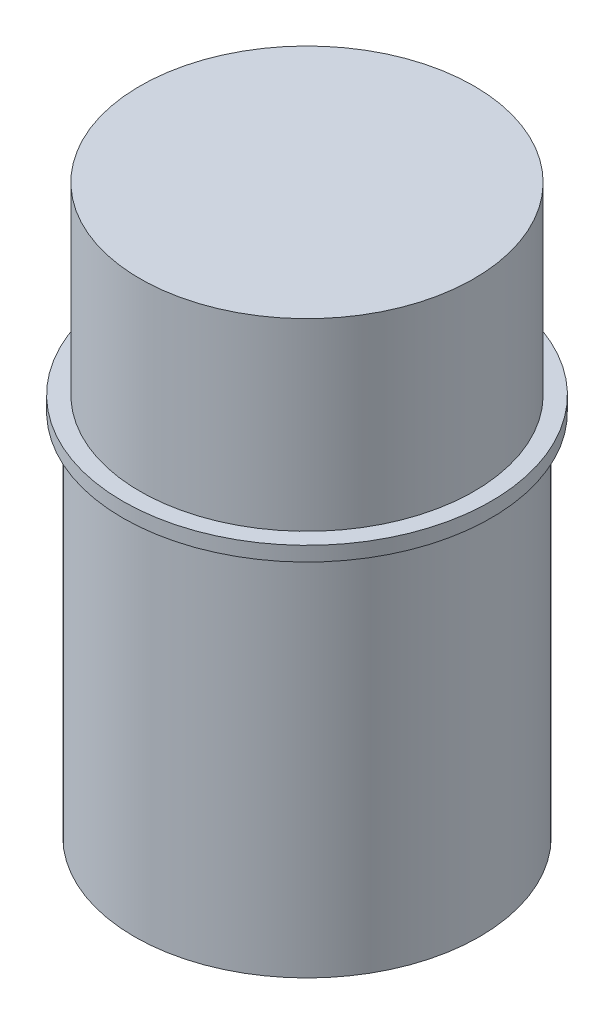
ISO-10303-21;
HEADER;
FILE_DESCRIPTION(('STEP AP214'),'2;1');
FILE_NAME('part.step','',(''),(''),'','','');
FILE_SCHEMA(('AUTOMOTIVE_DESIGN { 1 0 10303 214 1 1 1 1 }'));
ENDSEC;
DATA;
#1=APPLICATION_CONTEXT('core data for automotive mechanical design processes');
#2=APPLICATION_PROTOCOL_DEFINITION('international standard','automotive_design',2000,#1);
#3=PRODUCT_CONTEXT('',#1,'mechanical');
#4=PRODUCT('Part','Part','',(#3));
#5=PRODUCT_RELATED_PRODUCT_CATEGORY('part','',(#4));
#6=PRODUCT_DEFINITION_FORMATION('','',#4);
#7=PRODUCT_DEFINITION_CONTEXT('part definition',#1,'design');
#8=PRODUCT_DEFINITION('design','',#6,#7);
#9=PRODUCT_DEFINITION_SHAPE('','',#8);
#10=(LENGTH_UNIT() NAMED_UNIT(*) SI_UNIT(.MILLI.,.METRE.));
#11=(NAMED_UNIT(*) PLANE_ANGLE_UNIT() SI_UNIT($,.RADIAN.));
#12=(NAMED_UNIT(*) SI_UNIT($,.STERADIAN.) SOLID_ANGLE_UNIT());
#13=UNCERTAINTY_MEASURE_WITH_UNIT(LENGTH_MEASURE(1.E-05),#10,'distance_accuracy_value','');
#14=(GEOMETRIC_REPRESENTATION_CONTEXT(3) GLOBAL_UNCERTAINTY_ASSIGNED_CONTEXT((#13)) GLOBAL_UNIT_ASSIGNED_CONTEXT((#10,
#11,#12)) REPRESENTATION_CONTEXT('',''));
#15=CARTESIAN_POINT('',(0.,0.,0.));
#16=DIRECTION('',(0.,0.,1.));
#17=DIRECTION('',(1.,0.,0.));
#18=AXIS2_PLACEMENT_3D('',#15,#16,#17);
#19=CARTESIAN_POINT('',(0.,0.,0.));
#20=DIRECTION('',(0.,1.,0.));
#21=DIRECTION('',(0.,0.,1.));
#22=AXIS2_PLACEMENT_3D('',#19,#20,#21);
#23=PLANE('',#22);
#24=DIRECTION('',(1.,0.,0.));
#25=VECTOR('',#24,1.);
#26=CARTESIAN_POINT('',(0.,9.59999857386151E-08,-2.));
#27=LINE('',#26,#25);
#28=CARTESIAN_POINT('',(17.021994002,9.59999857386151E-08,-2.));
#29=VERTEX_POINT('',#28);
#30=CARTESIAN_POINT('',(20.021994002,9.59999857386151E-08,-2.));
#31=VERTEX_POINT('',#30);
#32=EDGE_CURVE('E114',#29,#31,#27,.T.);
#33=ORIENTED_EDGE('',*,*,#32,.F.);
#34=DIRECTION('',(0.,0.,1.));
#35=VECTOR('',#34,1.);
#36=CARTESIAN_POINT('',(17.021994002,9.59999857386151E-08,-2.));
#37=LINE('',#36,#35);
#38=CARTESIAN_POINT('',(17.021994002,9.59999857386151E-08,2.));
#39=VERTEX_POINT('',#38);
#40=EDGE_CURVE('E112',#29,#39,#37,.T.);
#41=ORIENTED_EDGE('',*,*,#40,.T.);
#42=DIRECTION('',(1.,0.,0.));
#43=VECTOR('',#42,1.);
#44=CARTESIAN_POINT('',(0.,9.59999857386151E-08,2.));
#45=LINE('',#44,#43);
#46=CARTESIAN_POINT('',(20.021994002,0.,2.));
#47=VERTEX_POINT('',#46);
#48=EDGE_CURVE('E95',#39,#47,#45,.T.);
#49=ORIENTED_EDGE('',*,*,#48,.T.);
#50=DIRECTION('',(0.,0.,1.));
#51=VECTOR('',#50,1.);
#52=CARTESIAN_POINT('',(20.021994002,9.59999857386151E-08,-2.));
#53=LINE('',#52,#51);
#54=EDGE_CURVE('E92',#31,#47,#53,.T.);
#55=ORIENTED_EDGE('',*,*,#54,.F.);
#56=EDGE_LOOP('',(#33,#41,#49,#55));
#57=FACE_BOUND('',#56,.T.);
#58=CARTESIAN_POINT('',(0.,0.,0.));
#59=DIRECTION('',(0.,1.,0.));
#60=DIRECTION('',(0.,0.,1.));
#61=AXIS2_PLACEMENT_3D('',#58,#59,#60);
#62=CIRCLE('',#61,35.725);
#63=CARTESIAN_POINT('',(0.,0.,-35.725));
#64=VERTEX_POINT('',#63);
#65=EDGE_CURVE('E49',#64,#64,#62,.T.);
#66=ORIENTED_EDGE('',*,*,#65,.F.);
#67=EDGE_LOOP('',(#66));
#68=FACE_BOUND('',#67,.T.);
#69=CARTESIAN_POINT('',(-20.021994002,9.59999857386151E-08,-2.));
#70=VERTEX_POINT('',#69);
#71=CARTESIAN_POINT('',(-17.021994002,9.59999857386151E-08,-2.));
#72=VERTEX_POINT('',#71);
#73=EDGE_CURVE('E106',#70,#72,#27,.T.);
#74=ORIENTED_EDGE('',*,*,#73,.F.);
#75=DIRECTION('',(0.,0.,1.));
#76=VECTOR('',#75,1.);
#77=CARTESIAN_POINT('',(-20.021994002,9.59999857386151E-08,-2.));
#78=LINE('',#77,#76);
#79=CARTESIAN_POINT('',(-20.021994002,9.59999857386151E-08,2.));
#80=VERTEX_POINT('',#79);
#81=EDGE_CURVE('E89',#70,#80,#78,.T.);
#82=ORIENTED_EDGE('',*,*,#81,.T.);
#83=CARTESIAN_POINT('',(-17.021994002,0.,2.));
#84=VERTEX_POINT('',#83);
#85=EDGE_CURVE('E96',#80,#84,#45,.T.);
#86=ORIENTED_EDGE('',*,*,#85,.T.);
#87=DIRECTION('',(0.,0.,1.));
#88=VECTOR('',#87,1.);
#89=CARTESIAN_POINT('',(-17.021994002,9.59999857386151E-08,-2.));
#90=LINE('',#89,#88);
#91=EDGE_CURVE('E122',#72,#84,#90,.T.);
#92=ORIENTED_EDGE('',*,*,#91,.F.);
#93=EDGE_LOOP('',(#74,#82,#86,#92));
#94=FACE_BOUND('',#93,.T.);
#95=ADVANCED_FACE('F45',(#57,#68,#94),#23,.F.);
#96=CARTESIAN_POINT('',(0.,117.3,0.));
#97=DIRECTION('',(0.,1.,0.));
#98=DIRECTION('',(0.,0.,1.));
#99=AXIS2_PLACEMENT_3D('',#96,#97,#98);
#100=PLANE('',#99);
#101=CARTESIAN_POINT('',(0.,117.3,0.));
#102=DIRECTION('',(0.,1.,0.));
#103=DIRECTION('',(0.,0.,1.));
#104=AXIS2_PLACEMENT_3D('',#101,#102,#103);
#105=CIRCLE('',#104,34.54904445);
#106=CARTESIAN_POINT('',(0.,117.3,-34.54904445));
#107=VERTEX_POINT('',#106);
#108=EDGE_CURVE('E118',#107,#107,#105,.T.);
#109=ORIENTED_EDGE('',*,*,#108,.T.);
#110=EDGE_LOOP('',(#109));
#111=FACE_BOUND('',#110,.T.);
#112=ADVANCED_FACE('F140',(#111),#100,.T.);
#113=CARTESIAN_POINT('',(0.,76.2,0.));
#114=DIRECTION('',(0.,-1.,0.));
#115=DIRECTION('',(0.,0.,-1.));
#116=AXIS2_PLACEMENT_3D('',#113,#114,#115);
#117=CYLINDRICAL_SURFACE('',#116,35.725);
#118=CARTESIAN_POINT('',(0.,76.2,0.));
#119=DIRECTION('',(0.,1.,0.));
#120=DIRECTION('',(0.,0.,1.));
#121=AXIS2_PLACEMENT_3D('',#118,#119,#120);
#122=CIRCLE('',#121,35.725);
#123=CARTESIAN_POINT('',(0.,76.2,-35.725));
#124=VERTEX_POINT('',#123);
#125=EDGE_CURVE('E55',#124,#124,#122,.T.);
#126=CARTESIAN_POINT('',(0.,76.2,-35.725));
#127=CARTESIAN_POINT('',(0.,75.40625,-35.725));
#128=CARTESIAN_POINT('',(0.,74.6125,-35.725));
#129=CARTESIAN_POINT('',(0.,73.025,-35.725));
#130=CARTESIAN_POINT('',(0.,72.23125,-35.725));
#131=CARTESIAN_POINT('',(0.,70.64375,-35.725));
#132=CARTESIAN_POINT('',(0.,69.85,-35.725));
#133=CARTESIAN_POINT('',(0.,68.2625,-35.725));
#134=CARTESIAN_POINT('',(0.,67.46875,-35.725));
#135=CARTESIAN_POINT('',(0.,65.88125,-35.725));
#136=CARTESIAN_POINT('',(0.,65.0875,-35.725));
#137=CARTESIAN_POINT('',(0.,63.5,-35.725));
#138=CARTESIAN_POINT('',(0.,62.70625,-35.725));
#139=CARTESIAN_POINT('',(0.,61.11875,-35.725));
#140=CARTESIAN_POINT('',(0.,60.325,-35.725));
#141=CARTESIAN_POINT('',(0.,58.7375,-35.725));
#142=CARTESIAN_POINT('',(0.,57.94375,-35.725));
#143=CARTESIAN_POINT('',(0.,56.35625,-35.725));
#144=CARTESIAN_POINT('',(0.,55.5625,-35.725));
#145=CARTESIAN_POINT('',(0.,53.975,-35.725));
#146=CARTESIAN_POINT('',(0.,53.18125,-35.725));
#147=CARTESIAN_POINT('',(0.,51.59375,-35.725));
#148=CARTESIAN_POINT('',(0.,50.8,-35.725));
#149=CARTESIAN_POINT('',(0.,49.2125,-35.725));
#150=CARTESIAN_POINT('',(0.,48.41875,-35.725));
#151=CARTESIAN_POINT('',(0.,46.83125,-35.725));
#152=CARTESIAN_POINT('',(0.,46.0375,-35.725));
#153=CARTESIAN_POINT('',(0.,44.45,-35.725));
#154=CARTESIAN_POINT('',(0.,43.65625,-35.725));
#155=CARTESIAN_POINT('',(0.,42.06875,-35.725));
#156=CARTESIAN_POINT('',(0.,41.275,-35.725));
#157=CARTESIAN_POINT('',(0.,39.6875,-35.725));
#158=CARTESIAN_POINT('',(0.,38.89375,-35.725));
#159=CARTESIAN_POINT('',(0.,37.30625,-35.725));
#160=CARTESIAN_POINT('',(0.,36.5125,-35.725));
#161=CARTESIAN_POINT('',(0.,34.925,-35.725));
#162=CARTESIAN_POINT('',(0.,34.13125,-35.725));
#163=CARTESIAN_POINT('',(0.,32.54375,-35.725));
#164=CARTESIAN_POINT('',(0.,31.75,-35.725));
#165=CARTESIAN_POINT('',(0.,30.1625,-35.725));
#166=CARTESIAN_POINT('',(0.,29.36875,-35.725));
#167=CARTESIAN_POINT('',(0.,27.78125,-35.725));
#168=CARTESIAN_POINT('',(0.,26.9875,-35.725));
#169=CARTESIAN_POINT('',(0.,25.4,-35.725));
#170=CARTESIAN_POINT('',(0.,24.60625,-35.725));
#171=CARTESIAN_POINT('',(0.,23.01875,-35.725));
#172=CARTESIAN_POINT('',(0.,22.225,-35.725));
#173=CARTESIAN_POINT('',(0.,20.6375,-35.725));
#174=CARTESIAN_POINT('',(0.,19.84375,-35.725));
#175=CARTESIAN_POINT('',(0.,18.25625,-35.725));
#176=CARTESIAN_POINT('',(0.,17.4625,-35.725));
#177=CARTESIAN_POINT('',(0.,15.875,-35.725));
#178=CARTESIAN_POINT('',(0.,15.08125,-35.725));
#179=CARTESIAN_POINT('',(0.,13.49375,-35.725));
#180=CARTESIAN_POINT('',(0.,12.7,-35.725));
#181=CARTESIAN_POINT('',(0.,11.1125,-35.725));
#182=CARTESIAN_POINT('',(0.,10.31875,-35.725));
#183=CARTESIAN_POINT('',(0.,8.73125,-35.725));
#184=CARTESIAN_POINT('',(0.,7.93750000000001,-35.725));
#185=CARTESIAN_POINT('',(0.,6.35,-35.725));
#186=CARTESIAN_POINT('',(0.,5.55625,-35.725));
#187=CARTESIAN_POINT('',(0.,3.96875,-35.725));
#188=CARTESIAN_POINT('',(0.,3.175,-35.725));
#189=CARTESIAN_POINT('',(0.,1.5875,-35.725));
#190=CARTESIAN_POINT('',(0.,0.793750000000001,-35.725));
#191=CARTESIAN_POINT('',(0.,0.,-35.725));
#192=B_SPLINE_CURVE_WITH_KNOTS('',3,(#126,#127,#128,#129,#130,#131,#132,#133,#134,#135,#136,
#137,#138,#139,#140,#141,#142,#143,#144,#145,#146,#147,#148,#149,#150,#151,#152,#153,#154,#155,
#156,#157,#158,#159,#160,#161,#162,#163,#164,#165,#166,#167,#168,#169,#170,#171,#172,#173,#174,
#175,#176,#177,#178,#179,#180,#181,#182,#183,#184,#185,#186,#187,#188,#189,#190,#191),
.UNSPECIFIED.,.F.,.F.,(4,2,2,2,2,2,2,2,2,2,2,2,2,2,2,2,2,2,2,2,2,2,2,2,2,2,2,2,2,2,2,2,4),(0.,
2.38125,4.7625,7.14375,9.52500000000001,11.90625,14.2875,16.66875,19.05,21.43125,23.8125,
26.19375,28.575,30.95625,33.3375,35.71875,38.1,40.48125,42.8625,45.24375,47.625,50.00625,
52.3875,54.76875,57.15,59.53125,61.9125,64.29375,66.675,69.05625,71.4375,73.81875,76.2),.UNSPECIFIED.);
#193=EDGE_CURVE('BSEAM47',#124,#64,#192,.T.);
#194=ORIENTED_EDGE('',*,*,#125,.F.);
#195=ORIENTED_EDGE('',*,*,#65,.T.);
#196=ORIENTED_EDGE('',*,*,#193,.T.);
#197=ORIENTED_EDGE('',*,*,#193,.F.);
#198=EDGE_LOOP('',(#194,#196,#195,#197));
#199=FACE_BOUND('',#198,.T.);
#200=ADVANCED_FACE('F47',(#199),#117,.T.);
#201=CARTESIAN_POINT('',(0.,79.2,0.));
#202=DIRECTION('',(0.,-1.,0.));
#203=DIRECTION('',(0.,0.,-1.));
#204=AXIS2_PLACEMENT_3D('',#201,#202,#203);
#205=CYLINDRICAL_SURFACE('',#204,38.1);
#206=CARTESIAN_POINT('',(0.,79.2,0.));
#207=DIRECTION('',(0.,1.,0.));
#208=DIRECTION('',(0.,0.,1.));
#209=AXIS2_PLACEMENT_3D('',#206,#207,#208);
#210=CIRCLE('',#209,38.1);
#211=CARTESIAN_POINT('',(0.,79.2,38.1));
#212=VERTEX_POINT('',#211);
#213=EDGE_CURVE('E124',#212,#212,#210,.T.);
#214=ORIENTED_EDGE('',*,*,#213,.F.);
#215=EDGE_LOOP('',(#214));
#216=FACE_BOUND('',#215,.T.);
#217=CARTESIAN_POINT('',(0.,76.2,0.));
#218=DIRECTION('',(0.,1.,0.));
#219=DIRECTION('',(0.,0.,1.));
#220=AXIS2_PLACEMENT_3D('',#217,#218,#219);
#221=CIRCLE('',#220,38.1);
#222=CARTESIAN_POINT('',(0.,76.2,38.1));
#223=VERTEX_POINT('',#222);
#224=EDGE_CURVE('E121',#223,#223,#221,.T.);
#225=ORIENTED_EDGE('',*,*,#224,.T.);
#226=EDGE_LOOP('',(#225));
#227=FACE_BOUND('',#226,.T.);
#228=ADVANCED_FACE('F151',(#216,#227),#205,.T.);
#229=CARTESIAN_POINT('',(0.,79.2,0.));
#230=DIRECTION('',(0.,1.,0.));
#231=DIRECTION('',(0.,0.,1.));
#232=AXIS2_PLACEMENT_3D('',#229,#230,#231);
#233=PLANE('',#232);
#234=CARTESIAN_POINT('',(0.,79.2,0.));
#235=DIRECTION('',(0.,1.,0.));
#236=DIRECTION('',(0.,0.,1.));
#237=AXIS2_PLACEMENT_3D('',#234,#235,#236);
#238=CIRCLE('',#237,34.54904445);
#239=CARTESIAN_POINT('',(0.,79.2,-34.54904445));
#240=VERTEX_POINT('',#239);
#241=EDGE_CURVE('E11',#240,#240,#238,.T.);
#242=ORIENTED_EDGE('',*,*,#241,.F.);
#243=EDGE_LOOP('',(#242));
#244=FACE_BOUND('',#243,.T.);
#245=ORIENTED_EDGE('',*,*,#213,.T.);
#246=EDGE_LOOP('',(#245));
#247=FACE_BOUND('',#246,.T.);
#248=ADVANCED_FACE('F154',(#244,#247),#233,.T.);
#249=CARTESIAN_POINT('',(0.,76.2,0.));
#250=DIRECTION('',(0.,1.,0.));
#251=DIRECTION('',(0.,0.,1.));
#252=AXIS2_PLACEMENT_3D('',#249,#250,#251);
#253=PLANE('',#252);
#254=ORIENTED_EDGE('',*,*,#125,.T.);
#255=EDGE_LOOP('',(#254));
#256=FACE_BOUND('',#255,.T.);
#257=ORIENTED_EDGE('',*,*,#224,.F.);
#258=EDGE_LOOP('',(#257));
#259=FACE_BOUND('',#258,.T.);
#260=ADVANCED_FACE('F156',(#256,#259),#253,.F.);
#261=CARTESIAN_POINT('',(0.,117.3,0.));
#262=DIRECTION('',(0.,-1.,0.));
#263=DIRECTION('',(0.,0.,-1.));
#264=AXIS2_PLACEMENT_3D('',#261,#262,#263);
#265=CYLINDRICAL_SURFACE('',#264,34.54904445);
#266=CARTESIAN_POINT('',(0.,117.3,-34.54904445));
#267=CARTESIAN_POINT('',(0.,116.903125,-34.54904445));
#268=CARTESIAN_POINT('',(0.,116.50625,-34.54904445));
#269=CARTESIAN_POINT('',(0.,115.7125,-34.54904445));
#270=CARTESIAN_POINT('',(0.,115.315625,-34.54904445));
#271=CARTESIAN_POINT('',(0.,114.521875,-34.54904445));
#272=CARTESIAN_POINT('',(0.,114.125,-34.54904445));
#273=CARTESIAN_POINT('',(0.,113.33125,-34.54904445));
#274=CARTESIAN_POINT('',(0.,112.934375,-34.54904445));
#275=CARTESIAN_POINT('',(0.,112.140625,-34.54904445));
#276=CARTESIAN_POINT('',(0.,111.74375,-34.54904445));
#277=CARTESIAN_POINT('',(0.,110.95,-34.54904445));
#278=CARTESIAN_POINT('',(0.,110.553125,-34.54904445));
#279=CARTESIAN_POINT('',(0.,109.759375,-34.54904445));
#280=CARTESIAN_POINT('',(0.,109.3625,-34.54904445));
#281=CARTESIAN_POINT('',(0.,108.56875,-34.54904445));
#282=CARTESIAN_POINT('',(0.,108.171875,-34.54904445));
#283=CARTESIAN_POINT('',(0.,107.378125,-34.54904445));
#284=CARTESIAN_POINT('',(0.,106.98125,-34.54904445));
#285=CARTESIAN_POINT('',(0.,106.1875,-34.54904445));
#286=CARTESIAN_POINT('',(0.,105.790625,-34.54904445));
#287=CARTESIAN_POINT('',(0.,104.996875,-34.54904445));
#288=CARTESIAN_POINT('',(0.,104.6,-34.54904445));
#289=CARTESIAN_POINT('',(0.,103.80625,-34.54904445));
#290=CARTESIAN_POINT('',(0.,103.409375,-34.54904445));
#291=CARTESIAN_POINT('',(0.,102.615625,-34.54904445));
#292=CARTESIAN_POINT('',(0.,102.21875,-34.54904445));
#293=CARTESIAN_POINT('',(0.,101.425,-34.54904445));
#294=CARTESIAN_POINT('',(0.,101.028125,-34.54904445));
#295=CARTESIAN_POINT('',(0.,100.234375,-34.54904445));
#296=CARTESIAN_POINT('',(0.,99.8375,-34.54904445));
#297=CARTESIAN_POINT('',(0.,99.04375,-34.54904445));
#298=CARTESIAN_POINT('',(0.,98.646875,-34.54904445));
#299=CARTESIAN_POINT('',(0.,97.853125,-34.54904445));
#300=CARTESIAN_POINT('',(0.,97.45625,-34.54904445));
#301=CARTESIAN_POINT('',(0.,96.6625,-34.54904445));
#302=CARTESIAN_POINT('',(0.,96.265625,-34.54904445));
#303=CARTESIAN_POINT('',(0.,95.471875,-34.54904445));
#304=CARTESIAN_POINT('',(0.,95.075,-34.54904445));
#305=CARTESIAN_POINT('',(0.,94.28125,-34.54904445));
#306=CARTESIAN_POINT('',(0.,93.884375,-34.54904445));
#307=CARTESIAN_POINT('',(0.,93.090625,-34.54904445));
#308=CARTESIAN_POINT('',(0.,92.69375,-34.54904445));
#309=CARTESIAN_POINT('',(0.,91.9,-34.54904445));
#310=CARTESIAN_POINT('',(0.,91.503125,-34.54904445));
#311=CARTESIAN_POINT('',(0.,90.709375,-34.54904445));
#312=CARTESIAN_POINT('',(0.,90.3125,-34.54904445));
#313=CARTESIAN_POINT('',(0.,89.51875,-34.54904445));
#314=CARTESIAN_POINT('',(0.,89.121875,-34.54904445));
#315=CARTESIAN_POINT('',(0.,88.328125,-34.54904445));
#316=CARTESIAN_POINT('',(0.,87.93125,-34.54904445));
#317=CARTESIAN_POINT('',(0.,87.1375,-34.54904445));
#318=CARTESIAN_POINT('',(0.,86.740625,-34.54904445));
#319=CARTESIAN_POINT('',(0.,85.946875,-34.54904445));
#320=CARTESIAN_POINT('',(0.,85.55,-34.54904445));
#321=CARTESIAN_POINT('',(0.,84.75625,-34.54904445));
#322=CARTESIAN_POINT('',(0.,84.359375,-34.54904445));
#323=CARTESIAN_POINT('',(0.,83.565625,-34.54904445));
#324=CARTESIAN_POINT('',(0.,83.16875,-34.54904445));
#325=CARTESIAN_POINT('',(0.,82.375,-34.54904445));
#326=CARTESIAN_POINT('',(0.,81.978125,-34.54904445));
#327=CARTESIAN_POINT('',(0.,81.184375,-34.54904445));
#328=CARTESIAN_POINT('',(0.,80.7875,-34.54904445));
#329=CARTESIAN_POINT('',(0.,79.99375,-34.54904445));
#330=CARTESIAN_POINT('',(0.,79.596875,-34.54904445));
#331=CARTESIAN_POINT('',(0.,79.2,-34.54904445));
#332=B_SPLINE_CURVE_WITH_KNOTS('',3,(#266,#267,#268,#269,#270,#271,#272,#273,#274,#275,#276,
#277,#278,#279,#280,#281,#282,#283,#284,#285,#286,#287,#288,#289,#290,#291,#292,#293,#294,#295,
#296,#297,#298,#299,#300,#301,#302,#303,#304,#305,#306,#307,#308,#309,#310,#311,#312,#313,#314,
#315,#316,#317,#318,#319,#320,#321,#322,#323,#324,#325,#326,#327,#328,#329,#330,#331),
.UNSPECIFIED.,.F.,.F.,(4,2,2,2,2,2,2,2,2,2,2,2,2,2,2,2,2,2,2,2,2,2,2,2,2,2,2,2,2,2,2,2,4),(0.,
1.19062499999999,2.38124999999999,3.57187499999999,4.76249999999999,5.95312499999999,
7.14374999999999,8.33437499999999,9.52499999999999,10.715625,11.90625,13.096875,14.2875,
15.478125,16.66875,17.859375,19.05,20.240625,21.43125,22.621875,23.8125,25.003125,26.19375,
27.384375,28.575,29.765625,30.95625,32.146875,33.3375,34.528125,35.71875,36.909375,38.1),.UNSPECIFIED.);
#333=EDGE_CURVE('BSEAM159',#107,#240,#332,.T.);
#334=ORIENTED_EDGE('',*,*,#108,.F.);
#335=ORIENTED_EDGE('',*,*,#241,.T.);
#336=ORIENTED_EDGE('',*,*,#333,.T.);
#337=ORIENTED_EDGE('',*,*,#333,.F.);
#338=EDGE_LOOP('',(#334,#336,#335,#337));
#339=FACE_BOUND('',#338,.T.);
#340=ADVANCED_FACE('F159',(#339),#265,.T.);
#341=CARTESIAN_POINT('',(0.,5.9197963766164,-2.));
#342=DIRECTION('',(0.,0.,1.));
#343=DIRECTION('',(1.,0.,0.));
#344=AXIS2_PLACEMENT_3D('',#341,#342,#343);
#345=CYLINDRICAL_SURFACE('',#344,18.021994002);
#346=ORIENTED_EDGE('',*,*,#91,.T.);
#347=CARTESIAN_POINT('',(0.,5.9197963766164,2.));
#348=DIRECTION('',(0.,0.,-1.));
#349=DIRECTION('',(1.,0.,0.));
#350=AXIS2_PLACEMENT_3D('',#347,#348,#349);
#351=CIRCLE('',#350,18.021994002);
#352=EDGE_CURVE('E63',#84,#39,#351,.F.);
#353=ORIENTED_EDGE('',*,*,#352,.T.);
#354=ORIENTED_EDGE('',*,*,#40,.F.);
#355=CARTESIAN_POINT('',(0.,5.9197963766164,-2.));
#356=DIRECTION('',(0.,0.,-1.));
#357=DIRECTION('',(1.,0.,0.));
#358=AXIS2_PLACEMENT_3D('',#355,#356,#357);
#359=CIRCLE('',#358,18.021994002);
#360=EDGE_CURVE('E108',#72,#29,#359,.F.);
#361=ORIENTED_EDGE('',*,*,#360,.F.);
#362=EDGE_LOOP('',(#346,#353,#354,#361));
#363=FACE_BOUND('',#362,.T.);
#364=ADVANCED_FACE('F163',(#363),#345,.F.);
#365=CARTESIAN_POINT('',(0.,3.53645542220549,-2.));
#366=DIRECTION('',(0.,0.,1.));
#367=DIRECTION('',(1.,0.,0.));
#368=AXIS2_PLACEMENT_3D('',#365,#366,#367);
#369=CYLINDRICAL_SURFACE('',#368,20.3319148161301);
#370=ORIENTED_EDGE('',*,*,#54,.T.);
#371=CARTESIAN_POINT('',(0.,3.53645542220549,2.));
#372=DIRECTION('',(0.,0.,-1.));
#373=DIRECTION('',(1.,0.,0.));
#374=AXIS2_PLACEMENT_3D('',#371,#372,#373);
#375=CIRCLE('',#374,20.3319148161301);
#376=EDGE_CURVE('E68',#80,#47,#375,.F.);
#377=ORIENTED_EDGE('',*,*,#376,.F.);
#378=ORIENTED_EDGE('',*,*,#81,.F.);
#379=CARTESIAN_POINT('',(0.,3.53645542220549,-2.));
#380=DIRECTION('',(0.,0.,-1.));
#381=DIRECTION('',(1.,0.,0.));
#382=AXIS2_PLACEMENT_3D('',#379,#380,#381);
#383=CIRCLE('',#382,20.3319148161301);
#384=EDGE_CURVE('E245',#70,#31,#383,.F.);
#385=ORIENTED_EDGE('',*,*,#384,.T.);
#386=EDGE_LOOP('',(#370,#377,#378,#385));
#387=FACE_BOUND('',#386,.T.);
#388=ADVANCED_FACE('F86',(#387),#369,.T.);
#389=CARTESIAN_POINT('',(0.,117.300000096,-2.));
#390=DIRECTION('',(0.,0.,1.));
#391=DIRECTION('',(1.,0.,0.));
#392=AXIS2_PLACEMENT_3D('',#389,#390,#391);
#393=PLANE('',#392);
#394=ORIENTED_EDGE('',*,*,#73,.T.);
#395=ORIENTED_EDGE('',*,*,#360,.T.);
#396=ORIENTED_EDGE('',*,*,#32,.T.);
#397=ORIENTED_EDGE('',*,*,#384,.F.);
#398=EDGE_LOOP('',(#394,#395,#396,#397));
#399=FACE_BOUND('',#398,.T.);
#400=ADVANCED_FACE('F168',(#399),#393,.F.);
#401=CARTESIAN_POINT('',(0.,117.300000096,2.));
#402=DIRECTION('',(0.,0.,1.));
#403=DIRECTION('',(1.,0.,0.));
#404=AXIS2_PLACEMENT_3D('',#401,#402,#403);
#405=PLANE('',#404);
#406=ORIENTED_EDGE('',*,*,#85,.F.);
#407=ORIENTED_EDGE('',*,*,#376,.T.);
#408=ORIENTED_EDGE('',*,*,#48,.F.);
#409=ORIENTED_EDGE('',*,*,#352,.F.);
#410=EDGE_LOOP('',(#406,#407,#408,#409));
#411=FACE_BOUND('',#410,.T.);
#412=ADVANCED_FACE('F99',(#411),#405,.T.);
#413=CLOSED_SHELL('',(#95,#112,#200,#228,#248,#260,#340,#364,#388,#400,#412));
#414=MANIFOLD_SOLID_BREP('B2',#413);
#415=ADVANCED_BREP_SHAPE_REPRESENTATION('',(#18,#414),#14);
#416=SHAPE_DEFINITION_REPRESENTATION(#9,#415);
ENDSEC;
END-ISO-10303-21;
